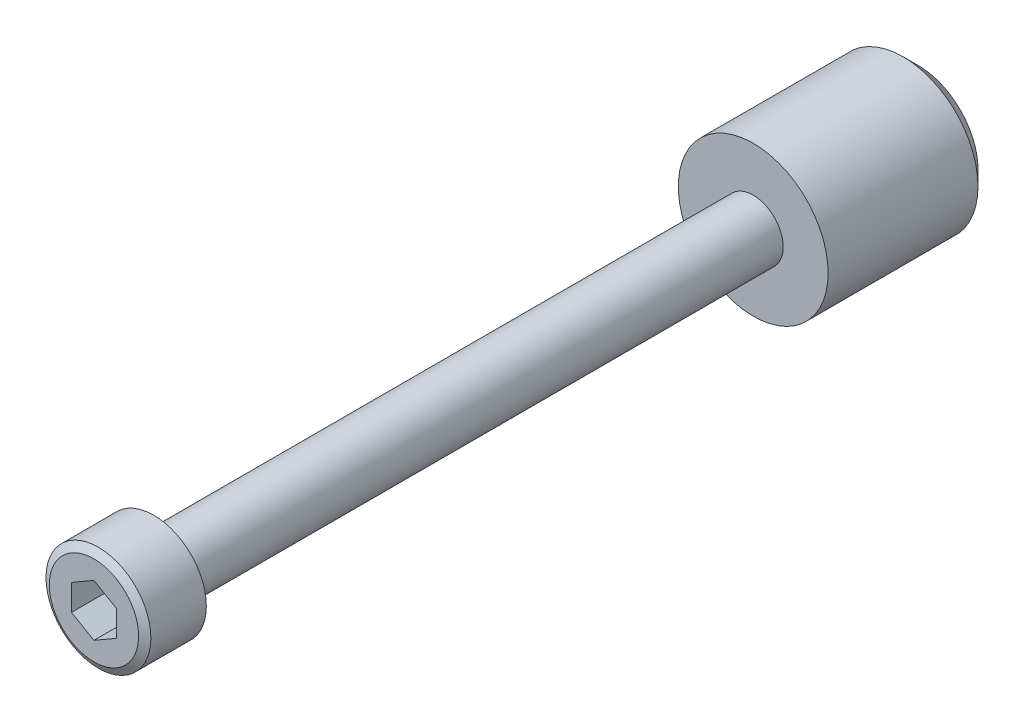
ISO-10303-21;
HEADER;
FILE_DESCRIPTION(('STEP AP214'),'2;1');
FILE_NAME('part.step','',(''),(''),'','','');
FILE_SCHEMA(('AUTOMOTIVE_DESIGN { 1 0 10303 214 1 1 1 1 }'));
ENDSEC;
DATA;
#1=APPLICATION_CONTEXT('core data for automotive mechanical design processes');
#2=APPLICATION_PROTOCOL_DEFINITION('international standard','automotive_design',2000,#1);
#3=PRODUCT_CONTEXT('',#1,'mechanical');
#4=PRODUCT('Part','Part','',(#3));
#5=PRODUCT_RELATED_PRODUCT_CATEGORY('part','',(#4));
#6=PRODUCT_DEFINITION_FORMATION('','',#4);
#7=PRODUCT_DEFINITION_CONTEXT('part definition',#1,'design');
#8=PRODUCT_DEFINITION('design','',#6,#7);
#9=PRODUCT_DEFINITION_SHAPE('','',#8);
#10=(LENGTH_UNIT() NAMED_UNIT(*) SI_UNIT(.MILLI.,.METRE.));
#11=(NAMED_UNIT(*) PLANE_ANGLE_UNIT() SI_UNIT($,.RADIAN.));
#12=(NAMED_UNIT(*) SI_UNIT($,.STERADIAN.) SOLID_ANGLE_UNIT());
#13=UNCERTAINTY_MEASURE_WITH_UNIT(LENGTH_MEASURE(1.E-05),#10,'distance_accuracy_value','');
#14=(GEOMETRIC_REPRESENTATION_CONTEXT(3) GLOBAL_UNCERTAINTY_ASSIGNED_CONTEXT((#13)) GLOBAL_UNIT_ASSIGNED_CONTEXT((#10,
#11,#12)) REPRESENTATION_CONTEXT('',''));
#15=CARTESIAN_POINT('',(0.,0.,0.));
#16=DIRECTION('',(0.,0.,1.));
#17=DIRECTION('',(1.,0.,0.));
#18=AXIS2_PLACEMENT_3D('',#15,#16,#17);
#19=CARTESIAN_POINT('',(5.06,-5.077411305,0.));
#20=DIRECTION('',(0.,0.,-1.));
#21=DIRECTION('',(-1.,0.,0.));
#22=AXIS2_PLACEMENT_3D('',#19,#20,#21);
#23=PLANE('',#22);
#24=CARTESIAN_POINT('',(0.,0.,0.));
#25=DIRECTION('',(0.,0.,-1.));
#26=DIRECTION('',(-1.,0.,0.));
#27=AXIS2_PLACEMENT_3D('',#24,#25,#26);
#28=CIRCLE('',#27,4.);
#29=CARTESIAN_POINT('',(-4.,0.,0.));
#30=VERTEX_POINT('',#29);
#31=EDGE_CURVE('E9',#30,#30,#28,.T.);
#32=ORIENTED_EDGE('',*,*,#31,.T.);
#33=EDGE_LOOP('',(#32));
#34=FACE_BOUND('',#33,.T.);
#35=ADVANCED_FACE('F14',(#34),#23,.T.);
#36=CARTESIAN_POINT('',(0.,0.,0.));
#37=DIRECTION('',(0.,0.,1.));
#38=DIRECTION('',(1.,0.,0.));
#39=AXIS2_PLACEMENT_3D('',#36,#37,#38);
#40=CYLINDRICAL_SURFACE('',#39,5.);
#41=CARTESIAN_POINT('',(0.,0.,1.));
#42=DIRECTION('',(0.,0.,-1.));
#43=DIRECTION('',(-1.,0.,0.));
#44=AXIS2_PLACEMENT_3D('',#41,#42,#43);
#45=CIRCLE('',#44,5.);
#46=CARTESIAN_POINT('',(-5.,0.,1.));
#47=VERTEX_POINT('',#46);
#48=EDGE_CURVE('E22',#47,#47,#45,.F.);
#49=ORIENTED_EDGE('',*,*,#48,.T.);
#50=EDGE_LOOP('',(#49));
#51=FACE_BOUND('',#50,.T.);
#52=CARTESIAN_POINT('',(0.,0.,11.));
#53=DIRECTION('',(0.,0.,1.));
#54=DIRECTION('',(1.,0.,0.));
#55=AXIS2_PLACEMENT_3D('',#52,#53,#54);
#56=CIRCLE('',#55,5.);
#57=CARTESIAN_POINT('',(5.,0.,11.));
#58=VERTEX_POINT('',#57);
#59=EDGE_CURVE('E116',#58,#58,#56,.T.);
#60=ORIENTED_EDGE('',*,*,#59,.F.);
#61=EDGE_LOOP('',(#60));
#62=FACE_BOUND('',#61,.T.);
#63=ADVANCED_FACE('F141',(#51,#62),#40,.T.);
#64=CARTESIAN_POINT('',(-5.06,-5.077411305,11.));
#65=DIRECTION('',(0.,0.,1.));
#66=DIRECTION('',(1.,0.,0.));
#67=AXIS2_PLACEMENT_3D('',#64,#65,#66);
#68=PLANE('',#67);
#69=CARTESIAN_POINT('',(0.,0.,11.));
#70=DIRECTION('',(0.,0.,1.));
#71=DIRECTION('',(1.,0.,0.));
#72=AXIS2_PLACEMENT_3D('',#69,#70,#71);
#73=CIRCLE('',#72,2.);
#74=CARTESIAN_POINT('',(2.,0.,11.));
#75=VERTEX_POINT('',#74);
#76=EDGE_CURVE('E134',#75,#75,#73,.T.);
#77=ORIENTED_EDGE('',*,*,#76,.F.);
#78=EDGE_LOOP('',(#77));
#79=FACE_BOUND('',#78,.T.);
#80=ORIENTED_EDGE('',*,*,#59,.T.);
#81=EDGE_LOOP('',(#80));
#82=FACE_BOUND('',#81,.T.);
#83=ADVANCED_FACE('F176',(#79,#82),#68,.T.);
#84=CARTESIAN_POINT('',(0.,0.,11.));
#85=DIRECTION('',(0.,0.,1.));
#86=DIRECTION('',(1.,0.,0.));
#87=AXIS2_PLACEMENT_3D('',#84,#85,#86);
#88=CYLINDRICAL_SURFACE('',#87,2.);
#89=ORIENTED_EDGE('',*,*,#76,.T.);
#90=EDGE_LOOP('',(#89));
#91=FACE_BOUND('',#90,.T.);
#92=CARTESIAN_POINT('',(0.,0.,51.));
#93=DIRECTION('',(0.,0.,1.));
#94=DIRECTION('',(1.,0.,0.));
#95=AXIS2_PLACEMENT_3D('',#92,#93,#94);
#96=CIRCLE('',#95,2.);
#97=CARTESIAN_POINT('',(2.,0.,51.));
#98=VERTEX_POINT('',#97);
#99=EDGE_CURVE('E131',#98,#98,#96,.T.);
#100=ORIENTED_EDGE('',*,*,#99,.F.);
#101=EDGE_LOOP('',(#100));
#102=FACE_BOUND('',#101,.T.);
#103=ADVANCED_FACE('F179',(#91,#102),#88,.T.);
#104=CARTESIAN_POINT('',(-3.016149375,-3.026527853,55.));
#105=DIRECTION('',(0.,0.,1.));
#106=DIRECTION('',(1.,0.,0.));
#107=AXIS2_PLACEMENT_3D('',#104,#105,#106);
#108=PLANE('',#107);
#109=DIRECTION('',(-0.866025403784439,0.5,0.));
#110=VECTOR('',#109,1.);
#111=CARTESIAN_POINT('',(1.5,0.86602540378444,55.));
#112=LINE('',#111,#110);
#113=CARTESIAN_POINT('',(1.5,0.86602540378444,55.));
#114=VERTEX_POINT('',#113);
#115=CARTESIAN_POINT('',(0.,1.73205080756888,55.));
#116=VERTEX_POINT('',#115);
#117=EDGE_CURVE('E29',#114,#116,#112,.T.);
#118=ORIENTED_EDGE('',*,*,#117,.F.);
#119=DIRECTION('',(0.,1.,0.));
#120=VECTOR('',#119,1.);
#121=CARTESIAN_POINT('',(1.5,-0.866025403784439,55.));
#122=LINE('',#121,#120);
#123=CARTESIAN_POINT('',(1.5,-0.866025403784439,55.));
#124=VERTEX_POINT('',#123);
#125=EDGE_CURVE('E112',#124,#114,#122,.T.);
#126=ORIENTED_EDGE('',*,*,#125,.F.);
#127=DIRECTION('',(0.866025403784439,0.5,0.));
#128=VECTOR('',#127,1.);
#129=CARTESIAN_POINT('',(0.,-1.73205080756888,55.));
#130=LINE('',#129,#128);
#131=CARTESIAN_POINT('',(0.,-1.73205080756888,55.));
#132=VERTEX_POINT('',#131);
#133=EDGE_CURVE('E110',#132,#124,#130,.T.);
#134=ORIENTED_EDGE('',*,*,#133,.F.);
#135=DIRECTION('',(0.866025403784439,-0.5,0.));
#136=VECTOR('',#135,1.);
#137=CARTESIAN_POINT('',(-1.5,-0.866025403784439,55.));
#138=LINE('',#137,#136);
#139=CARTESIAN_POINT('',(-1.5,-0.866025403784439,55.));
#140=VERTEX_POINT('',#139);
#141=EDGE_CURVE('E77',#140,#132,#138,.T.);
#142=ORIENTED_EDGE('',*,*,#141,.F.);
#143=DIRECTION('',(0.,-1.,0.));
#144=VECTOR('',#143,1.);
#145=CARTESIAN_POINT('',(-1.5,0.866025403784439,55.));
#146=LINE('',#145,#144);
#147=CARTESIAN_POINT('',(-1.5,0.866025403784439,55.));
#148=VERTEX_POINT('',#147);
#149=EDGE_CURVE('E106',#148,#140,#146,.T.);
#150=ORIENTED_EDGE('',*,*,#149,.F.);
#151=DIRECTION('',(-0.866025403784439,-0.5,0.));
#152=VECTOR('',#151,1.);
#153=CARTESIAN_POINT('',(0.,1.73205080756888,55.));
#154=LINE('',#153,#152);
#155=EDGE_CURVE('E103',#116,#148,#154,.T.);
#156=ORIENTED_EDGE('',*,*,#155,.F.);
#157=EDGE_LOOP('',(#118,#126,#134,#142,#150,#156));
#158=FACE_BOUND('',#157,.T.);
#159=CARTESIAN_POINT('',(0.,0.,55.));
#160=DIRECTION('',(0.,0.,-1.));
#161=DIRECTION('',(-1.,0.,0.));
#162=AXIS2_PLACEMENT_3D('',#159,#160,#161);
#163=CIRCLE('',#162,2.980384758);
#164=CARTESIAN_POINT('',(-2.980384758,0.,55.));
#165=VERTEX_POINT('',#164);
#166=EDGE_CURVE('E128',#165,#165,#163,.T.);
#167=ORIENTED_EDGE('',*,*,#166,.F.);
#168=EDGE_LOOP('',(#167));
#169=FACE_BOUND('',#168,.T.);
#170=ADVANCED_FACE('F181',(#158,#169),#108,.T.);
#171=CARTESIAN_POINT('',(3.542,-3.554187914,51.));
#172=DIRECTION('',(0.,0.,-1.));
#173=DIRECTION('',(-1.,0.,0.));
#174=AXIS2_PLACEMENT_3D('',#171,#172,#173);
#175=PLANE('',#174);
#176=ORIENTED_EDGE('',*,*,#99,.T.);
#177=EDGE_LOOP('',(#176));
#178=FACE_BOUND('',#177,.T.);
#179=CARTESIAN_POINT('',(0.,0.,51.));
#180=DIRECTION('',(0.,0.,1.));
#181=DIRECTION('',(1.,0.,0.));
#182=AXIS2_PLACEMENT_3D('',#179,#180,#181);
#183=CIRCLE('',#182,3.5);
#184=CARTESIAN_POINT('',(3.5,0.,51.));
#185=VERTEX_POINT('',#184);
#186=EDGE_CURVE('E125',#185,#185,#183,.T.);
#187=ORIENTED_EDGE('',*,*,#186,.F.);
#188=EDGE_LOOP('',(#187));
#189=FACE_BOUND('',#188,.T.);
#190=ADVANCED_FACE('F167',(#178,#189),#175,.T.);
#191=CARTESIAN_POINT('',(0.,0.,55.));
#192=DIRECTION('',(0.,0.,-1.));
#193=DIRECTION('',(-1.,0.,0.));
#194=AXIS2_PLACEMENT_3D('',#191,#192,#193);
#195=CONICAL_SURFACE('',#194,2.980384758,1.04719755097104);
#196=CARTESIAN_POINT('',(0.,0.,54.7));
#197=DIRECTION('',(0.,0.,1.));
#198=DIRECTION('',(1.,0.,0.));
#199=AXIS2_PLACEMENT_3D('',#196,#197,#198);
#200=CIRCLE('',#199,3.5);
#201=CARTESIAN_POINT('',(3.5,0.,54.7));
#202=VERTEX_POINT('',#201);
#203=EDGE_CURVE('E122',#202,#202,#200,.F.);
#204=ORIENTED_EDGE('',*,*,#203,.F.);
#205=EDGE_LOOP('',(#204));
#206=FACE_BOUND('',#205,.T.);
#207=ORIENTED_EDGE('',*,*,#166,.T.);
#208=EDGE_LOOP('',(#207));
#209=FACE_BOUND('',#208,.T.);
#210=ADVANCED_FACE('F157',(#206,#209),#195,.T.);
#211=CARTESIAN_POINT('',(0.,0.,51.));
#212=DIRECTION('',(0.,0.,1.));
#213=DIRECTION('',(1.,0.,0.));
#214=AXIS2_PLACEMENT_3D('',#211,#212,#213);
#215=CYLINDRICAL_SURFACE('',#214,3.5);
#216=ORIENTED_EDGE('',*,*,#203,.T.);
#217=EDGE_LOOP('',(#216));
#218=FACE_BOUND('',#217,.T.);
#219=ORIENTED_EDGE('',*,*,#186,.T.);
#220=EDGE_LOOP('',(#219));
#221=FACE_BOUND('',#220,.T.);
#222=ADVANCED_FACE('F154',(#218,#221),#215,.T.);
#223=CARTESIAN_POINT('',(1.5,0.86602540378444,52.8));
#224=DIRECTION('',(0.5,0.866025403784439,0.));
#225=DIRECTION('',(-0.866025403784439,0.5,0.));
#226=AXIS2_PLACEMENT_3D('',#223,#224,#225);
#227=PLANE('',#226);
#228=ORIENTED_EDGE('',*,*,#117,.T.);
#229=DIRECTION('',(0.,0.,1.));
#230=VECTOR('',#229,1.);
#231=CARTESIAN_POINT('',(0.,1.73205080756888,52.8));
#232=LINE('',#231,#230);
#233=CARTESIAN_POINT('',(0.,1.73205080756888,52.8));
#234=VERTEX_POINT('',#233);
#235=EDGE_CURVE('E59',#234,#116,#232,.T.);
#236=ORIENTED_EDGE('',*,*,#235,.F.);
#237=DIRECTION('',(-0.866025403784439,0.5,0.));
#238=VECTOR('',#237,1.);
#239=CARTESIAN_POINT('',(1.5,0.86602540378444,52.8));
#240=LINE('',#239,#238);
#241=CARTESIAN_POINT('',(1.5,0.86602540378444,52.8));
#242=VERTEX_POINT('',#241);
#243=EDGE_CURVE('E114',#242,#234,#240,.T.);
#244=ORIENTED_EDGE('',*,*,#243,.F.);
#245=DIRECTION('',(0.,0.,1.));
#246=VECTOR('',#245,1.);
#247=CARTESIAN_POINT('',(1.5,0.86602540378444,52.8));
#248=LINE('',#247,#246);
#249=EDGE_CURVE('E37',#242,#114,#248,.T.);
#250=ORIENTED_EDGE('',*,*,#249,.T.);
#251=EDGE_LOOP('',(#228,#236,#244,#250));
#252=FACE_BOUND('',#251,.T.);
#253=ADVANCED_FACE('F156',(#252),#227,.F.);
#254=CARTESIAN_POINT('',(1.5,-0.866025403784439,52.8));
#255=DIRECTION('',(1.,0.,0.));
#256=DIRECTION('',(0.,0.,-1.));
#257=AXIS2_PLACEMENT_3D('',#254,#255,#256);
#258=PLANE('',#257);
#259=ORIENTED_EDGE('',*,*,#125,.T.);
#260=ORIENTED_EDGE('',*,*,#249,.F.);
#261=DIRECTION('',(0.,1.,0.));
#262=VECTOR('',#261,1.);
#263=CARTESIAN_POINT('',(1.5,-0.866025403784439,52.8));
#264=LINE('',#263,#262);
#265=CARTESIAN_POINT('',(1.5,-0.866025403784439,52.8));
#266=VERTEX_POINT('',#265);
#267=EDGE_CURVE('E89',#266,#242,#264,.T.);
#268=ORIENTED_EDGE('',*,*,#267,.F.);
#269=DIRECTION('',(0.,0.,1.));
#270=VECTOR('',#269,1.);
#271=CARTESIAN_POINT('',(1.5,-0.866025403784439,52.8));
#272=LINE('',#271,#270);
#273=EDGE_CURVE('E81',#266,#124,#272,.T.);
#274=ORIENTED_EDGE('',*,*,#273,.T.);
#275=EDGE_LOOP('',(#259,#260,#268,#274));
#276=FACE_BOUND('',#275,.T.);
#277=ADVANCED_FACE('F165',(#276),#258,.F.);
#278=CARTESIAN_POINT('',(0.,-1.73205080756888,52.8));
#279=DIRECTION('',(0.5,-0.866025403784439,0.));
#280=DIRECTION('',(0.866025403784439,0.5,0.));
#281=AXIS2_PLACEMENT_3D('',#278,#279,#280);
#282=PLANE('',#281);
#283=ORIENTED_EDGE('',*,*,#133,.T.);
#284=ORIENTED_EDGE('',*,*,#273,.F.);
#285=DIRECTION('',(0.866025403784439,0.5,0.));
#286=VECTOR('',#285,1.);
#287=CARTESIAN_POINT('',(0.,-1.73205080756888,52.8));
#288=LINE('',#287,#286);
#289=CARTESIAN_POINT('',(0.,-1.73205080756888,52.8));
#290=VERTEX_POINT('',#289);
#291=EDGE_CURVE('E85',#290,#266,#288,.T.);
#292=ORIENTED_EDGE('',*,*,#291,.F.);
#293=DIRECTION('',(0.,0.,1.));
#294=VECTOR('',#293,1.);
#295=CARTESIAN_POINT('',(0.,-1.73205080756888,52.8));
#296=LINE('',#295,#294);
#297=EDGE_CURVE('E70',#290,#132,#296,.T.);
#298=ORIENTED_EDGE('',*,*,#297,.T.);
#299=EDGE_LOOP('',(#283,#284,#292,#298));
#300=FACE_BOUND('',#299,.T.);
#301=ADVANCED_FACE('F86',(#300),#282,.F.);
#302=CARTESIAN_POINT('',(-1.5,-0.866025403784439,52.8));
#303=DIRECTION('',(-0.5,-0.866025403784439,0.));
#304=DIRECTION('',(0.866025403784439,-0.5,0.));
#305=AXIS2_PLACEMENT_3D('',#302,#303,#304);
#306=PLANE('',#305);
#307=ORIENTED_EDGE('',*,*,#141,.T.);
#308=ORIENTED_EDGE('',*,*,#297,.F.);
#309=DIRECTION('',(0.866025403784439,-0.5,0.));
#310=VECTOR('',#309,1.);
#311=CARTESIAN_POINT('',(-1.5,-0.866025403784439,52.8));
#312=LINE('',#311,#310);
#313=CARTESIAN_POINT('',(-1.5,-0.866025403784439,52.8));
#314=VERTEX_POINT('',#313);
#315=EDGE_CURVE('E74',#314,#290,#312,.T.);
#316=ORIENTED_EDGE('',*,*,#315,.F.);
#317=DIRECTION('',(0.,0.,1.));
#318=VECTOR('',#317,1.);
#319=CARTESIAN_POINT('',(-1.5,-0.866025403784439,52.8));
#320=LINE('',#319,#318);
#321=EDGE_CURVE('E82',#314,#140,#320,.T.);
#322=ORIENTED_EDGE('',*,*,#321,.T.);
#323=EDGE_LOOP('',(#307,#308,#316,#322));
#324=FACE_BOUND('',#323,.T.);
#325=ADVANCED_FACE('F72',(#324),#306,.F.);
#326=CARTESIAN_POINT('',(-1.5,0.866025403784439,52.8));
#327=DIRECTION('',(-1.,0.,0.));
#328=DIRECTION('',(0.,-1.,0.));
#329=AXIS2_PLACEMENT_3D('',#326,#327,#328);
#330=PLANE('',#329);
#331=ORIENTED_EDGE('',*,*,#149,.T.);
#332=ORIENTED_EDGE('',*,*,#321,.F.);
#333=DIRECTION('',(0.,-1.,0.));
#334=VECTOR('',#333,1.);
#335=CARTESIAN_POINT('',(-1.5,0.866025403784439,52.8));
#336=LINE('',#335,#334);
#337=CARTESIAN_POINT('',(-1.5,0.866025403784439,52.8));
#338=VERTEX_POINT('',#337);
#339=EDGE_CURVE('E95',#338,#314,#336,.T.);
#340=ORIENTED_EDGE('',*,*,#339,.F.);
#341=DIRECTION('',(0.,0.,1.));
#342=VECTOR('',#341,1.);
#343=CARTESIAN_POINT('',(-1.5,0.866025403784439,52.8));
#344=LINE('',#343,#342);
#345=EDGE_CURVE('E119',#338,#148,#344,.T.);
#346=ORIENTED_EDGE('',*,*,#345,.T.);
#347=EDGE_LOOP('',(#331,#332,#340,#346));
#348=FACE_BOUND('',#347,.T.);
#349=ADVANCED_FACE('F203',(#348),#330,.F.);
#350=CARTESIAN_POINT('',(0.,1.73205080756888,52.8));
#351=DIRECTION('',(-0.5,0.866025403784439,0.));
#352=DIRECTION('',(-0.866025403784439,-0.5,0.));
#353=AXIS2_PLACEMENT_3D('',#350,#351,#352);
#354=PLANE('',#353);
#355=ORIENTED_EDGE('',*,*,#155,.T.);
#356=ORIENTED_EDGE('',*,*,#345,.F.);
#357=DIRECTION('',(-0.866025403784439,-0.5,0.));
#358=VECTOR('',#357,1.);
#359=CARTESIAN_POINT('',(0.,1.73205080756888,52.8));
#360=LINE('',#359,#358);
#361=EDGE_CURVE('E97',#234,#338,#360,.T.);
#362=ORIENTED_EDGE('',*,*,#361,.F.);
#363=ORIENTED_EDGE('',*,*,#235,.T.);
#364=EDGE_LOOP('',(#355,#356,#362,#363));
#365=FACE_BOUND('',#364,.T.);
#366=ADVANCED_FACE('F151',(#365),#354,.F.);
#367=CARTESIAN_POINT('',(0.,1.73205080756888,52.8));
#368=DIRECTION('',(0.,0.,1.));
#369=DIRECTION('',(1.,0.,0.));
#370=AXIS2_PLACEMENT_3D('',#367,#368,#369);
#371=PLANE('',#370);
#372=ORIENTED_EDGE('',*,*,#243,.T.);
#373=ORIENTED_EDGE('',*,*,#361,.T.);
#374=ORIENTED_EDGE('',*,*,#339,.T.);
#375=ORIENTED_EDGE('',*,*,#315,.T.);
#376=ORIENTED_EDGE('',*,*,#291,.T.);
#377=ORIENTED_EDGE('',*,*,#267,.T.);
#378=EDGE_LOOP('',(#372,#373,#374,#375,#376,#377));
#379=FACE_BOUND('',#378,.T.);
#380=ADVANCED_FACE('F92',(#379),#371,.T.);
#381=CARTESIAN_POINT('',(0.,0.,1.));
#382=DIRECTION('',(0.,0.,1.));
#383=DIRECTION('',(1.,0.,0.));
#384=AXIS2_PLACEMENT_3D('',#381,#382,#383);
#385=CONICAL_SURFACE('',#384,5.,0.785398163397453);
#386=ORIENTED_EDGE('',*,*,#31,.F.);
#387=EDGE_LOOP('',(#386));
#388=FACE_BOUND('',#387,.T.);
#389=ORIENTED_EDGE('',*,*,#48,.F.);
#390=EDGE_LOOP('',(#389));
#391=FACE_BOUND('',#390,.T.);
#392=ADVANCED_FACE('F16',(#388,#391),#385,.T.);
#393=CLOSED_SHELL('',(#35,#63,#83,#103,#170,#190,#210,#222,#253,#277,#301,#325,#349,#366,#380,#392));
#394=MANIFOLD_SOLID_BREP('B1',#393);
#395=ADVANCED_BREP_SHAPE_REPRESENTATION('',(#18,#394),#14);
#396=SHAPE_DEFINITION_REPRESENTATION(#9,#395);
ENDSEC;
END-ISO-10303-21;
